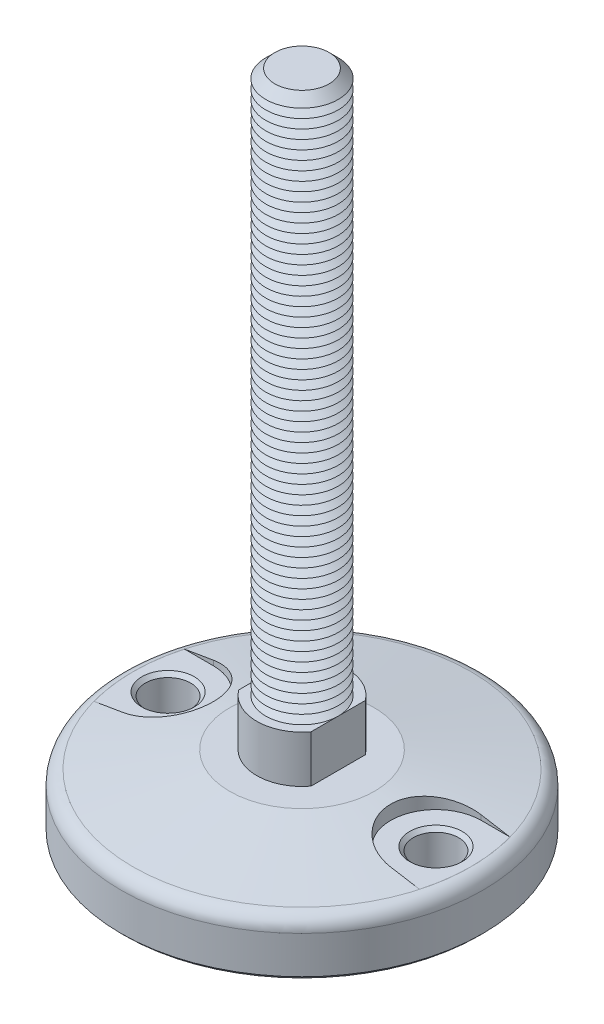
from build123d import *

# Parameters (mm, degrees)
FILLET1_R                = 4
SKETCH3_R                = 12.5
BOSS_EXTRUDE1_DEPTH      = 13
CUT_EXTRUDE1_START       = -13
CUT_EXTRUDE1_DEPTH       = 13
SKETCH5_R                = 10
BOSS_EXTRUDE2_DEPTH      = 150
CHAMFER1_SIZE            = 2.5
LPATTERN1_COUNT          = 59
LPATTERN1_PITCH          = 2.5
CUT_EXTRUDE4_DEPTH       = 4.7
SKETCH10_R               = 6.25
CUT_EXTRUDE5_DEPTH       = 15.3
CHAMFER2_SIZE            = 1
CHAMFER2_OF_MIRROR1_SIZE = 1
CHAMFER3_SIZE            = 1


with BuildPart() as part:
    # Sketch2 → Revolve1 (revolve)
    with BuildSketch(Plane(origin=(0, 0, 0), x_dir=(0, 0, -1), z_dir=(1, 0, 0))):
        Polygon((0, 0), (-20, 0), (-50, -5.289809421), (-50, -20), (0, -20), align=None)
    revolve(axis=Axis((0, 61.338865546, 0), (0, -1, 0)))

    # Fillet1
    fillet1_edges = [part.edges().sort_by_distance(p)[0] for p in [
        (0, -5.289809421, -50),
    ]]
    fillet(fillet1_edges, radius=FILLET1_R)

    # Sketch3 → Boss-Extrude1 (add)
    with BuildSketch(Plane(origin=(0, 0, 0), x_dir=(1, 0, 0), z_dir=(0, 1, 0))):
        with Locations(Location((0, 0, 0), (0, 0, 90))):
            Circle(SKETCH3_R)
    extrude(amount=BOSS_EXTRUDE1_DEPTH)

    # Sketch4 → Cut-Extrude1 (cut)
    with BuildSketch(Plane(origin=(0, 13, 0), x_dir=(1, 0, 0), z_dir=(0, 1, 0)).offset(CUT_EXTRUDE1_START)):
        with BuildLine():
            Line((-10, 7.5), (-10, -7.5))
            ThreePointArc((-10, -7.5), (-12.5, 0), (-10, 7.5))
        make_face()
        with BuildLine():
            Line((10, -7.5), (10, 7.5))
            ThreePointArc((10, 7.5), (12.5, 0), (10, -7.5))
        make_face()
    extrude(amount=CUT_EXTRUDE1_DEPTH, mode=Mode.SUBTRACT)

    # Sketch5 → Boss-Extrude2 (add)
    with BuildSketch(Plane(origin=(0, 13, 0), x_dir=(1, 0, 0), z_dir=(0, 1, 0))):
        with Locations(Location((0, 0, 0), (0, 0, 180))):
            Circle(SKETCH5_R)
    extrude(amount=BOSS_EXTRUDE2_DEPTH)

    # Chamfer1
    chamfer1_edges = [part.edges().sort_by_distance(p)[0] for p in [
        (10, 163, 0),
    ]]
    chamfer(chamfer1_edges, length=CHAMFER1_SIZE)

    # Sketch6 → Cut-Revolve1 (revolve, cut)
    with BuildSketch(Plane(origin=(0, 0, 0), x_dir=(0, 0, -1), z_dir=(1, 0, 0))):
        Polygon((-10, 13), (-7.834936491, 14.25), (-10, 15.5), align=None)
    cut_revolve1 = revolve(axis=Axis((0, 61.338865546, 0), (0, -1, 0)), mode=Mode.SUBTRACT)

    # LPattern1: Cut-Revolve1 ×59
    with Locations(*[(0, i * LPATTERN1_PITCH, 0) for i in range(1, LPATTERN1_COUNT)]):
        add(cut_revolve1, mode=Mode.SUBTRACT)

    # Sketch8 → Cut-Extrude4 (cut)
    with BuildSketch(Plane(origin=(0, 0, 0), x_dir=(1, 0, 0), z_dir=(0, 1, 0))):
        with BuildLine():
            Line((-37, 12.5), (-44.990387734, 12.5))
            ThreePointArc((-44.990387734, 12.5), (-46.694592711, 0), (-44.990387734, -12.5))
            Line((-44.990387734, -12.5), (-37, -12.5))
            ThreePointArc((-37, -12.5), (-24.5, 0), (-37, 12.5))
        make_face()
    cut_extrude4 = extrude(amount=-CUT_EXTRUDE4_DEPTH, mode=Mode.SUBTRACT)

    # Sketch10 → Cut-Extrude5 (cut)
    with BuildSketch(Plane(origin=(0, -4.7, 0), x_dir=(1, 0, 0), z_dir=(0, 1, 0))):
        with Locations(Location((-37, 0, 0), (0, 0, 270))):
            Circle(SKETCH10_R)
    cut_extrude5 = extrude(amount=-CUT_EXTRUDE5_DEPTH, mode=Mode.SUBTRACT)

    # Chamfer2
    chamfer2_edges = [part.edges().sort_by_distance(p)[0] for p in [
        (-37, -4.7, -6.25),
        (-37, -20, -6.25),
    ]]
    chamfer(chamfer2_edges, length=CHAMFER2_SIZE)

    # Mirror1: Cut-Extrude4, Cut-Extrude5 across plane
    add(cut_extrude4.mirror(Plane(origin=(0, 0, 0), x_dir=(0, 0, 1), z_dir=(1, 0, 0))), mode=Mode.SUBTRACT)
    add(cut_extrude5.mirror(Plane(origin=(0, 0, 0), x_dir=(0, 0, 1), z_dir=(1, 0, 0))), mode=Mode.SUBTRACT)

    # Chamfer2 of Mirror1
    chamfer2_of_mirror1_edges = [part.edges().sort_by_distance(p)[0] for p in [
        (37, -4.7, -6.25),
        (37, -20, -6.25),
    ]]
    chamfer(chamfer2_of_mirror1_edges, length=CHAMFER2_OF_MIRROR1_SIZE)

    # Chamfer3
    chamfer3_edges = [part.edges().sort_by_distance(p)[0] for p in [
        (0, -20, -50),
    ]]
    chamfer(chamfer3_edges, length=CHAMFER3_SIZE)


solid = part.part
